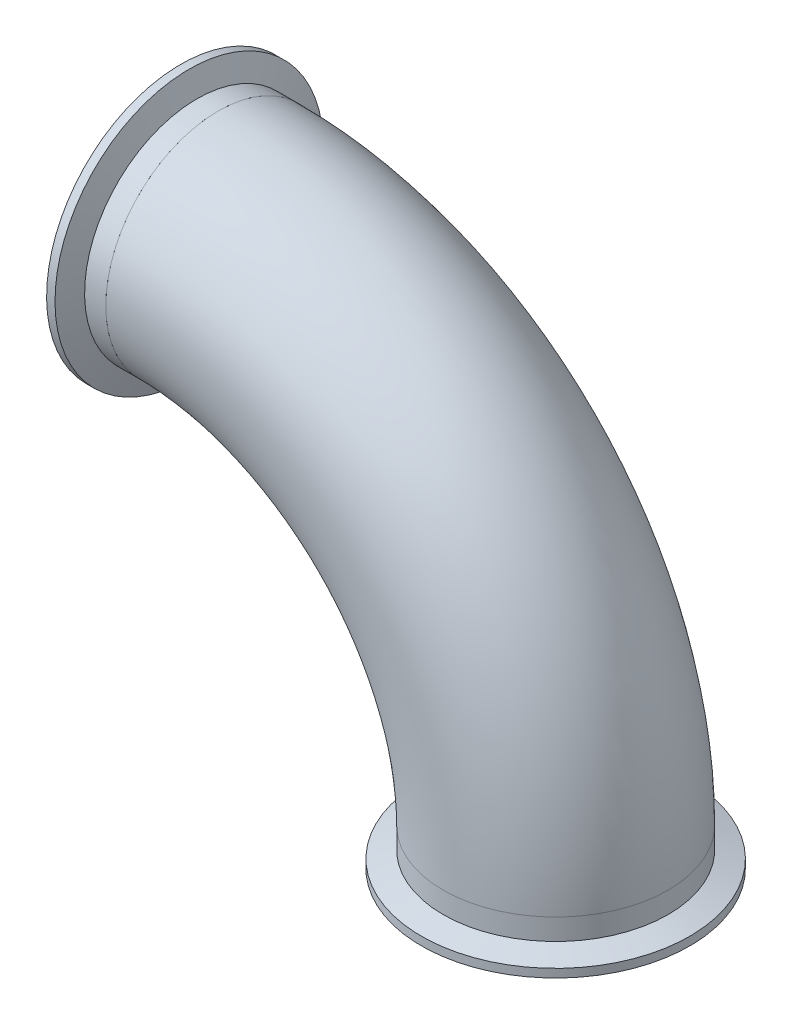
ISO-10303-21;
HEADER;
FILE_DESCRIPTION(('STEP AP214'),'2;1');
FILE_NAME('part.step','',(''),(''),'','','');
FILE_SCHEMA(('AUTOMOTIVE_DESIGN { 1 0 10303 214 1 1 1 1 }'));
ENDSEC;
DATA;
#1=APPLICATION_CONTEXT('core data for automotive mechanical design processes');
#2=APPLICATION_PROTOCOL_DEFINITION('international standard','automotive_design',2000,#1);
#3=PRODUCT_CONTEXT('',#1,'mechanical');
#4=PRODUCT('Part','Part','',(#3));
#5=PRODUCT_RELATED_PRODUCT_CATEGORY('part','',(#4));
#6=PRODUCT_DEFINITION_FORMATION('','',#4);
#7=PRODUCT_DEFINITION_CONTEXT('part definition',#1,'design');
#8=PRODUCT_DEFINITION('design','',#6,#7);
#9=PRODUCT_DEFINITION_SHAPE('','',#8);
#10=(LENGTH_UNIT() NAMED_UNIT(*) SI_UNIT(.MILLI.,.METRE.));
#11=(NAMED_UNIT(*) PLANE_ANGLE_UNIT() SI_UNIT($,.RADIAN.));
#12=(NAMED_UNIT(*) SI_UNIT($,.STERADIAN.) SOLID_ANGLE_UNIT());
#13=UNCERTAINTY_MEASURE_WITH_UNIT(LENGTH_MEASURE(1.E-05),#10,'distance_accuracy_value','');
#14=(GEOMETRIC_REPRESENTATION_CONTEXT(3) GLOBAL_UNCERTAINTY_ASSIGNED_CONTEXT((#13)) GLOBAL_UNIT_ASSIGNED_CONTEXT((#10,
#11,#12)) REPRESENTATION_CONTEXT('',''));
#15=CARTESIAN_POINT('',(0.,0.,0.));
#16=DIRECTION('',(0.,0.,1.));
#17=DIRECTION('',(1.,0.,0.));
#18=AXIS2_PLACEMENT_3D('',#15,#16,#17);
#19=CARTESIAN_POINT('',(137.453026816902,43.9271471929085,150.876164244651));
#20=DIRECTION('',(0.,-1.00000000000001,0.));
#21=DIRECTION('',(0.,0.,-1.));
#22=AXIS2_PLACEMENT_3D('',#19,#20,#21);
#23=TOROIDAL_SURFACE('',#22,43.4867084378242,0.787400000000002);
#24=CARTESIAN_POINT('',(137.453026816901,43.1397471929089,150.876164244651));
#25=DIRECTION('',(0.,-1.00000000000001,0.));
#26=DIRECTION('',(0.,0.,-1.));
#27=AXIS2_PLACEMENT_3D('',#24,#25,#26);
#28=CIRCLE('',#27,43.4867084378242);
#29=CARTESIAN_POINT('',(137.453026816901,43.1397471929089,107.389455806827));
#30=VERTEX_POINT('',#29);
#31=EDGE_CURVE('P0_E48',#30,#30,#28,.T.);
#32=ORIENTED_EDGE('',*,*,#31,.T.);
#33=EDGE_LOOP('',(#32));
#34=FACE_BOUND('',#33,.T.);
#35=CARTESIAN_POINT('',(137.453026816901,43.6142061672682,150.876164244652));
#36=DIRECTION('',(0.,-1.00000000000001,0.));
#37=DIRECTION('',(0.,0.,-1.));
#38=AXIS2_PLACEMENT_3D('',#35,#36,#37);
#39=CIRCLE('',#38,42.7641666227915);
#40=CARTESIAN_POINT('',(137.453026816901,43.6142061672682,108.11199762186));
#41=VERTEX_POINT('',#40);
#42=EDGE_CURVE('P0_E9',#41,#41,#39,.T.);
#43=ORIENTED_EDGE('',*,*,#42,.F.);
#44=EDGE_LOOP('',(#43));
#45=FACE_BOUND('',#44,.T.);
#46=ADVANCED_FACE('P0_F14',(#34,#45),#23,.T.);
#47=CARTESIAN_POINT('',(137.453026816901,43.1397471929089,150.876164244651));
#48=DIRECTION('',(0.,-1.00000000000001,0.));
#49=DIRECTION('',(0.,0.,-1.));
#50=AXIS2_PLACEMENT_3D('',#47,#48,#49);
#51=TOROIDAL_SURFACE('',#50,41.6687,1.1938);
#52=CARTESIAN_POINT('',(137.453026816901,43.6142061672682,150.876164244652));
#53=DIRECTION('',(0.,-1.00000000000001,0.));
#54=DIRECTION('',(0.,0.,-1.));
#55=AXIS2_PLACEMENT_3D('',#52,#53,#54);
#56=CIRCLE('',#55,40.5732333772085);
#57=CARTESIAN_POINT('',(137.453026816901,43.6142061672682,110.302930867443));
#58=VERTEX_POINT('',#57);
#59=EDGE_CURVE('P0_E20',#58,#58,#56,.T.);
#60=ORIENTED_EDGE('',*,*,#59,.F.);
#61=EDGE_LOOP('',(#60));
#62=FACE_BOUND('',#61,.T.);
#63=ORIENTED_EDGE('',*,*,#42,.T.);
#64=EDGE_LOOP('',(#63));
#65=FACE_BOUND('',#64,.T.);
#66=ADVANCED_FACE('P0_F97',(#62,#65),#51,.F.);
#67=CARTESIAN_POINT('',(137.453026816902,43.9271471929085,150.876164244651));
#68=DIRECTION('',(0.,-1.00000000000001,0.));
#69=DIRECTION('',(0.,0.,-1.));
#70=AXIS2_PLACEMENT_3D('',#67,#68,#69);
#71=TOROIDAL_SURFACE('',#70,39.8506915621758,0.787399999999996);
#72=ORIENTED_EDGE('',*,*,#59,.T.);
#73=EDGE_LOOP('',(#72));
#74=FACE_BOUND('',#73,.T.);
#75=CARTESIAN_POINT('',(137.453026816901,43.1397471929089,150.876164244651));
#76=DIRECTION('',(0.,-1.00000000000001,0.));
#77=DIRECTION('',(0.,0.,-1.));
#78=AXIS2_PLACEMENT_3D('',#75,#76,#77);
#79=CIRCLE('',#78,39.8506915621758);
#80=CARTESIAN_POINT('',(137.453026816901,43.1397471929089,111.025472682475));
#81=VERTEX_POINT('',#80);
#82=EDGE_CURVE('P0_E24',#81,#81,#79,.T.);
#83=ORIENTED_EDGE('',*,*,#82,.F.);
#84=EDGE_LOOP('',(#83));
#85=FACE_BOUND('',#84,.T.);
#86=ADVANCED_FACE('P0_F93',(#74,#85),#71,.T.);
#87=CARTESIAN_POINT('',(137.453026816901,43.1397471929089,150.876164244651));
#88=DIRECTION('',(0.,1.00000000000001,0.));
#89=DIRECTION('',(0.,0.,1.));
#90=AXIS2_PLACEMENT_3D('',#87,#88,#89);
#91=PLANE('',#90);
#92=CARTESIAN_POINT('',(137.453026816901,43.1397471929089,150.876164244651));
#93=DIRECTION('',(0.,-1.00000000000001,0.));
#94=DIRECTION('',(0.,0.,-1.));
#95=AXIS2_PLACEMENT_3D('',#92,#93,#94);
#96=CIRCLE('',#95,36.449);
#97=CARTESIAN_POINT('',(137.453026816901,43.1397471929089,114.427164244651));
#98=VERTEX_POINT('',#97);
#99=EDGE_CURVE('P0_E28',#98,#98,#96,.T.);
#100=ORIENTED_EDGE('',*,*,#99,.F.);
#101=EDGE_LOOP('',(#100));
#102=FACE_BOUND('',#101,.T.);
#103=ORIENTED_EDGE('',*,*,#82,.T.);
#104=EDGE_LOOP('',(#103));
#105=FACE_BOUND('',#104,.T.);
#106=ADVANCED_FACE('P0_F86',(#102,#105),#91,.F.);
#107=CARTESIAN_POINT('',(137.453026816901,43.1397471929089,150.876164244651));
#108=DIRECTION('',(0.,-1.00000000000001,0.));
#109=DIRECTION('',(0.,0.,-1.));
#110=AXIS2_PLACEMENT_3D('',#107,#108,#109);
#111=CYLINDRICAL_SURFACE('',#110,36.449);
#112=ORIENTED_EDGE('',*,*,#99,.T.);
#113=EDGE_LOOP('',(#112));
#114=FACE_BOUND('',#113,.T.);
#115=CARTESIAN_POINT('',(137.453026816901,55.8397471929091,150.876164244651));
#116=DIRECTION('',(0.,-1.00000000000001,0.));
#117=DIRECTION('',(0.,0.,-1.));
#118=AXIS2_PLACEMENT_3D('',#115,#116,#117);
#119=CIRCLE('',#118,36.449);
#120=CARTESIAN_POINT('',(137.453026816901,55.8397471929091,114.427164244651));
#121=VERTEX_POINT('',#120);
#122=EDGE_CURVE('P0_E33',#121,#121,#119,.T.);
#123=ORIENTED_EDGE('',*,*,#122,.F.);
#124=EDGE_LOOP('',(#123));
#125=FACE_BOUND('',#124,.T.);
#126=ADVANCED_FACE('P0_F81',(#114,#125),#111,.F.);
#127=CARTESIAN_POINT('',(137.453026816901,55.8397471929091,150.876164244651));
#128=DIRECTION('',(0.,-1.00000000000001,0.));
#129=DIRECTION('',(0.,0.,-1.));
#130=AXIS2_PLACEMENT_3D('',#127,#128,#129);
#131=PLANE('',#130);
#132=CARTESIAN_POINT('',(137.453026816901,55.8397471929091,150.876164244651));
#133=DIRECTION('',(0.,-1.00000000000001,0.));
#134=DIRECTION('',(0.,0.,-1.));
#135=AXIS2_PLACEMENT_3D('',#132,#133,#134);
#136=CIRCLE('',#135,38.1);
#137=CARTESIAN_POINT('',(137.453026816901,55.8397471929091,112.776164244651));
#138=VERTEX_POINT('',#137);
#139=EDGE_CURVE('P0_E36',#138,#138,#136,.T.);
#140=ORIENTED_EDGE('',*,*,#139,.F.);
#141=EDGE_LOOP('',(#140));
#142=FACE_BOUND('',#141,.T.);
#143=ORIENTED_EDGE('',*,*,#122,.T.);
#144=EDGE_LOOP('',(#143));
#145=FACE_BOUND('',#144,.T.);
#146=ADVANCED_FACE('P0_F75',(#142,#145),#131,.F.);
#147=CARTESIAN_POINT('',(137.453026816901,43.1397471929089,150.876164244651));
#148=DIRECTION('',(0.,-1.00000000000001,0.));
#149=DIRECTION('',(0.,0.,-1.));
#150=AXIS2_PLACEMENT_3D('',#147,#148,#149);
#151=CYLINDRICAL_SURFACE('',#150,38.1);
#152=CARTESIAN_POINT('',(137.453026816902,48.6609295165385,150.876164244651));
#153=DIRECTION('',(0.,-1.00000000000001,0.));
#154=DIRECTION('',(0.,0.,-1.));
#155=AXIS2_PLACEMENT_3D('',#152,#153,#154);
#156=CIRCLE('',#155,38.1);
#157=CARTESIAN_POINT('',(137.453026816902,48.6609295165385,112.776164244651));
#158=VERTEX_POINT('',#157);
#159=EDGE_CURVE('P0_E39',#158,#158,#156,.T.);
#160=ORIENTED_EDGE('',*,*,#159,.F.);
#161=EDGE_LOOP('',(#160));
#162=FACE_BOUND('',#161,.T.);
#163=ORIENTED_EDGE('',*,*,#139,.T.);
#164=EDGE_LOOP('',(#163));
#165=FACE_BOUND('',#164,.T.);
#166=ADVANCED_FACE('P0_F69',(#162,#165),#151,.T.);
#167=CARTESIAN_POINT('',(137.453026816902,48.6609295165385,150.876164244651));
#168=DIRECTION('',(0.,-1.00000000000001,0.));
#169=DIRECTION('',(0.,0.,-1.));
#170=AXIS2_PLACEMENT_3D('',#167,#168,#169);
#171=CONICAL_SURFACE('',#170,38.1,1.22173047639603);
#172=CARTESIAN_POINT('',(137.453026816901,45.9845471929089,150.87616424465));
#173=DIRECTION('',(0.,-1.00000000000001,0.));
#174=DIRECTION('',(0.,0.,-1.));
#175=AXIS2_PLACEMENT_3D('',#172,#173,#174);
#176=CIRCLE('',#175,45.4533);
#177=CARTESIAN_POINT('',(137.453026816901,45.9845471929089,105.42286424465));
#178=VERTEX_POINT('',#177);
#179=EDGE_CURVE('P0_E42',#178,#178,#176,.T.);
#180=ORIENTED_EDGE('',*,*,#179,.F.);
#181=EDGE_LOOP('',(#180));
#182=FACE_BOUND('',#181,.T.);
#183=ORIENTED_EDGE('',*,*,#159,.T.);
#184=EDGE_LOOP('',(#183));
#185=FACE_BOUND('',#184,.T.);
#186=ADVANCED_FACE('P0_F63',(#182,#185),#171,.T.);
#187=CARTESIAN_POINT('',(137.453026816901,43.1397471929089,150.876164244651));
#188=DIRECTION('',(0.,-1.00000000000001,0.));
#189=DIRECTION('',(0.,0.,-1.));
#190=AXIS2_PLACEMENT_3D('',#187,#188,#189);
#191=CYLINDRICAL_SURFACE('',#190,45.4533);
#192=CARTESIAN_POINT('',(137.453026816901,43.1397471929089,150.876164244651));
#193=DIRECTION('',(0.,-1.00000000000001,0.));
#194=DIRECTION('',(0.,0.,-1.));
#195=AXIS2_PLACEMENT_3D('',#192,#193,#194);
#196=CIRCLE('',#195,45.4533);
#197=CARTESIAN_POINT('',(137.453026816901,43.1397471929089,105.422864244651));
#198=VERTEX_POINT('',#197);
#199=EDGE_CURVE('P0_E45',#198,#198,#196,.T.);
#200=ORIENTED_EDGE('',*,*,#199,.F.);
#201=EDGE_LOOP('',(#200));
#202=FACE_BOUND('',#201,.T.);
#203=ORIENTED_EDGE('',*,*,#179,.T.);
#204=EDGE_LOOP('',(#203));
#205=FACE_BOUND('',#204,.T.);
#206=ADVANCED_FACE('P0_F57',(#202,#205),#191,.T.);
#207=CARTESIAN_POINT('',(137.453026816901,43.1397471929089,150.876164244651));
#208=DIRECTION('',(0.,1.00000000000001,0.));
#209=DIRECTION('',(0.,0.,1.));
#210=AXIS2_PLACEMENT_3D('',#207,#208,#209);
#211=PLANE('',#210);
#212=ORIENTED_EDGE('',*,*,#31,.F.);
#213=EDGE_LOOP('',(#212));
#214=FACE_BOUND('',#213,.T.);
#215=ORIENTED_EDGE('',*,*,#199,.T.);
#216=EDGE_LOOP('',(#215));
#217=FACE_BOUND('',#216,.T.);
#218=ADVANCED_FACE('P0_F54',(#214,#217),#211,.F.);
#219=CLOSED_SHELL('',(#46,#66,#86,#106,#126,#146,#166,#186,#206,#218));
#220=MANIFOLD_SOLID_BREP('P0_B1',#219);
#221=CARTESIAN_POINT('',(11.2404268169,170.139747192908,150.87616424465));
#222=DIRECTION('',(-1.00000000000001,0.,0.));
#223=DIRECTION('',(0.,0.518359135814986,-0.855163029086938));
#224=AXIS2_PLACEMENT_3D('',#221,#222,#223);
#225=TOROIDAL_SURFACE('',#224,43.4867084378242,0.787400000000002);
#226=CARTESIAN_POINT('',(10.4530268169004,170.139747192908,150.87616424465));
#227=DIRECTION('',(-1.00000000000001,0.,0.));
#228=DIRECTION('',(0.,0.518359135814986,-0.855163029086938));
#229=AXIS2_PLACEMENT_3D('',#226,#227,#228);
#230=CIRCLE('',#229,43.4867084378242);
#231=CARTESIAN_POINT('',(10.4530268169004,192.681479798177,113.68793893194));
#232=VERTEX_POINT('',#231);
#233=EDGE_CURVE('P1_E49',#232,#232,#230,.T.);
#234=ORIENTED_EDGE('',*,*,#233,.T.);
#235=EDGE_LOOP('',(#234));
#236=FACE_BOUND('',#235,.T.);
#237=CARTESIAN_POINT('',(10.9274857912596,170.139747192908,150.876164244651));
#238=DIRECTION('',(-1.00000000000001,0.,0.));
#239=DIRECTION('',(0.,0.518359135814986,-0.855163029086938));
#240=AXIS2_PLACEMENT_3D('',#237,#238,#239);
#241=CIRCLE('',#240,42.7641666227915);
#242=CARTESIAN_POINT('',(10.9274857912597,192.306943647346,114.305829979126));
#243=VERTEX_POINT('',#242);
#244=EDGE_CURVE('P1_E10',#243,#243,#241,.T.);
#245=ORIENTED_EDGE('',*,*,#244,.F.);
#246=EDGE_LOOP('',(#245));
#247=FACE_BOUND('',#246,.T.);
#248=ADVANCED_FACE('P1_F15',(#236,#247),#225,.T.);
#249=CARTESIAN_POINT('',(10.4530268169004,170.139747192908,150.87616424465));
#250=DIRECTION('',(-1.00000000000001,0.,0.));
#251=DIRECTION('',(0.,0.518359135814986,-0.855163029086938));
#252=AXIS2_PLACEMENT_3D('',#249,#250,#251);
#253=TOROIDAL_SURFACE('',#252,41.6687,1.1938);
#254=CARTESIAN_POINT('',(10.9274857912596,170.139747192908,150.876164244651));
#255=DIRECTION('',(-1.00000000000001,0.,0.));
#256=DIRECTION('',(0.,0.518359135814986,-0.855163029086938));
#257=AXIS2_PLACEMENT_3D('',#254,#255,#256);
#258=CIRCLE('',#257,40.5732333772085);
#259=CARTESIAN_POINT('',(10.9274857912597,191.171253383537,116.179435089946));
#260=VERTEX_POINT('',#259);
#261=EDGE_CURVE('P1_E21',#260,#260,#258,.T.);
#262=ORIENTED_EDGE('',*,*,#261,.F.);
#263=EDGE_LOOP('',(#262));
#264=FACE_BOUND('',#263,.T.);
#265=ORIENTED_EDGE('',*,*,#244,.T.);
#266=EDGE_LOOP('',(#265));
#267=FACE_BOUND('',#266,.T.);
#268=ADVANCED_FACE('P1_F98',(#264,#267),#253,.F.);
#269=CARTESIAN_POINT('',(11.2404268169,170.139747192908,150.87616424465));
#270=DIRECTION('',(-1.00000000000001,0.,0.));
#271=DIRECTION('',(0.,0.518359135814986,-0.855163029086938));
#272=AXIS2_PLACEMENT_3D('',#269,#270,#271);
#273=TOROIDAL_SURFACE('',#272,39.8506915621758,0.787399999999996);
#274=ORIENTED_EDGE('',*,*,#261,.T.);
#275=EDGE_LOOP('',(#274));
#276=FACE_BOUND('',#275,.T.);
#277=CARTESIAN_POINT('',(10.4530268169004,170.139747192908,150.87616424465));
#278=DIRECTION('',(-1.00000000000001,0.,0.));
#279=DIRECTION('',(0.,0.518359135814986,-0.855163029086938));
#280=AXIS2_PLACEMENT_3D('',#277,#278,#279);
#281=CIRCLE('',#280,39.8506915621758);
#282=CARTESIAN_POINT('',(10.4530268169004,190.796717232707,116.797326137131));
#283=VERTEX_POINT('',#282);
#284=EDGE_CURVE('P1_E25',#283,#283,#281,.T.);
#285=ORIENTED_EDGE('',*,*,#284,.F.);
#286=EDGE_LOOP('',(#285));
#287=FACE_BOUND('',#286,.T.);
#288=ADVANCED_FACE('P1_F94',(#276,#287),#273,.T.);
#289=CARTESIAN_POINT('',(10.4530268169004,170.139747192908,150.87616424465));
#290=DIRECTION('',(1.00000000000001,0.,0.));
#291=DIRECTION('',(0.,-0.518359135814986,0.855163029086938));
#292=AXIS2_PLACEMENT_3D('',#289,#290,#291);
#293=PLANE('',#292);
#294=CARTESIAN_POINT('',(10.4530268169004,170.139747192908,150.87616424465));
#295=DIRECTION('',(-1.00000000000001,0.,0.));
#296=DIRECTION('',(0.,0.518359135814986,-0.855163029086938));
#297=AXIS2_PLACEMENT_3D('',#294,#295,#296);
#298=CIRCLE('',#297,36.449);
#299=CARTESIAN_POINT('',(10.4530268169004,189.033419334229,119.706326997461));
#300=VERTEX_POINT('',#299);
#301=EDGE_CURVE('P1_E29',#300,#300,#298,.T.);
#302=ORIENTED_EDGE('',*,*,#301,.F.);
#303=EDGE_LOOP('',(#302));
#304=FACE_BOUND('',#303,.T.);
#305=ORIENTED_EDGE('',*,*,#284,.T.);
#306=EDGE_LOOP('',(#305));
#307=FACE_BOUND('',#306,.T.);
#308=ADVANCED_FACE('P1_F87',(#304,#307),#293,.F.);
#309=CARTESIAN_POINT('',(10.4530268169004,170.139747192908,150.87616424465));
#310=DIRECTION('',(-1.00000000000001,0.,0.));
#311=DIRECTION('',(0.,0.518359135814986,-0.855163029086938));
#312=AXIS2_PLACEMENT_3D('',#309,#310,#311);
#313=CYLINDRICAL_SURFACE('',#312,36.449);
#314=ORIENTED_EDGE('',*,*,#301,.T.);
#315=EDGE_LOOP('',(#314));
#316=FACE_BOUND('',#315,.T.);
#317=CARTESIAN_POINT('',(23.1530268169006,170.139747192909,150.876164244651));
#318=DIRECTION('',(-1.00000000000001,0.,0.));
#319=DIRECTION('',(0.,0.518359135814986,-0.855163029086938));
#320=AXIS2_PLACEMENT_3D('',#317,#318,#319);
#321=CIRCLE('',#320,36.449);
#322=CARTESIAN_POINT('',(23.1530268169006,189.033419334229,119.706326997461));
#323=VERTEX_POINT('',#322);
#324=EDGE_CURVE('P1_E34',#323,#323,#321,.T.);
#325=ORIENTED_EDGE('',*,*,#324,.F.);
#326=EDGE_LOOP('',(#325));
#327=FACE_BOUND('',#326,.T.);
#328=ADVANCED_FACE('P1_F82',(#316,#327),#313,.F.);
#329=CARTESIAN_POINT('',(23.1530268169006,170.139747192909,150.876164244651));
#330=DIRECTION('',(-1.00000000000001,0.,0.));
#331=DIRECTION('',(0.,0.518359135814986,-0.855163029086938));
#332=AXIS2_PLACEMENT_3D('',#329,#330,#331);
#333=PLANE('',#332);
#334=CARTESIAN_POINT('',(23.1530268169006,170.139747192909,150.876164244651));
#335=DIRECTION('',(-1.00000000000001,0.,0.));
#336=DIRECTION('',(0.,0.518359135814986,-0.855163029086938));
#337=AXIS2_PLACEMENT_3D('',#334,#335,#336);
#338=CIRCLE('',#337,38.1);
#339=CARTESIAN_POINT('',(23.1530268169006,189.88923026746,118.294452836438));
#340=VERTEX_POINT('',#339);
#341=EDGE_CURVE('P1_E37',#340,#340,#338,.T.);
#342=ORIENTED_EDGE('',*,*,#341,.F.);
#343=EDGE_LOOP('',(#342));
#344=FACE_BOUND('',#343,.T.);
#345=ORIENTED_EDGE('',*,*,#324,.T.);
#346=EDGE_LOOP('',(#345));
#347=FACE_BOUND('',#346,.T.);
#348=ADVANCED_FACE('P1_F76',(#344,#347),#333,.F.);
#349=CARTESIAN_POINT('',(10.4530268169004,170.139747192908,150.87616424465));
#350=DIRECTION('',(-1.00000000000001,0.,0.));
#351=DIRECTION('',(0.,0.518359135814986,-0.855163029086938));
#352=AXIS2_PLACEMENT_3D('',#349,#350,#351);
#353=CYLINDRICAL_SURFACE('',#352,38.1);
#354=CARTESIAN_POINT('',(15.97420914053,170.139747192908,150.876164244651));
#355=DIRECTION('',(-1.00000000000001,0.,0.));
#356=DIRECTION('',(0.,0.518359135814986,-0.855163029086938));
#357=AXIS2_PLACEMENT_3D('',#354,#355,#356);
#358=CIRCLE('',#357,38.1);
#359=CARTESIAN_POINT('',(15.97420914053,189.889230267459,118.294452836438));
#360=VERTEX_POINT('',#359);
#361=EDGE_CURVE('P1_E40',#360,#360,#358,.T.);
#362=ORIENTED_EDGE('',*,*,#361,.F.);
#363=EDGE_LOOP('',(#362));
#364=FACE_BOUND('',#363,.T.);
#365=ORIENTED_EDGE('',*,*,#341,.T.);
#366=EDGE_LOOP('',(#365));
#367=FACE_BOUND('',#366,.T.);
#368=ADVANCED_FACE('P1_F70',(#364,#367),#353,.T.);
#369=CARTESIAN_POINT('',(15.97420914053,170.139747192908,150.876164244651));
#370=DIRECTION('',(-1.00000000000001,0.,0.));
#371=DIRECTION('',(0.,0.518359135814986,-0.855163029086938));
#372=AXIS2_PLACEMENT_3D('',#369,#370,#371);
#373=CONICAL_SURFACE('',#372,38.1,1.22173047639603);
#374=CARTESIAN_POINT('',(13.2978268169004,170.139747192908,150.87616424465));
#375=DIRECTION('',(-1.00000000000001,0.,0.));
#376=DIRECTION('',(0.,0.518359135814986,-0.855163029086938));
#377=AXIS2_PLACEMENT_3D('',#374,#375,#376);
#378=CIRCLE('',#377,45.4533);
#379=CARTESIAN_POINT('',(13.2978268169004,193.700880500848,112.006182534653));
#380=VERTEX_POINT('',#379);
#381=EDGE_CURVE('P1_E43',#380,#380,#378,.T.);
#382=ORIENTED_EDGE('',*,*,#381,.F.);
#383=EDGE_LOOP('',(#382));
#384=FACE_BOUND('',#383,.T.);
#385=ORIENTED_EDGE('',*,*,#361,.T.);
#386=EDGE_LOOP('',(#385));
#387=FACE_BOUND('',#386,.T.);
#388=ADVANCED_FACE('P1_F64',(#384,#387),#373,.T.);
#389=CARTESIAN_POINT('',(10.4530268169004,170.139747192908,150.87616424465));
#390=DIRECTION('',(-1.00000000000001,0.,0.));
#391=DIRECTION('',(0.,0.518359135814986,-0.855163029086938));
#392=AXIS2_PLACEMENT_3D('',#389,#390,#391);
#393=CYLINDRICAL_SURFACE('',#392,45.4533);
#394=CARTESIAN_POINT('',(10.4530268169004,170.139747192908,150.87616424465));
#395=DIRECTION('',(-1.00000000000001,0.,0.));
#396=DIRECTION('',(0.,0.518359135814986,-0.855163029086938));
#397=AXIS2_PLACEMENT_3D('',#394,#395,#396);
#398=CIRCLE('',#397,45.4533);
#399=CARTESIAN_POINT('',(10.4530268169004,193.700880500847,112.006182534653));
#400=VERTEX_POINT('',#399);
#401=EDGE_CURVE('P1_E46',#400,#400,#398,.T.);
#402=ORIENTED_EDGE('',*,*,#401,.F.);
#403=EDGE_LOOP('',(#402));
#404=FACE_BOUND('',#403,.T.);
#405=ORIENTED_EDGE('',*,*,#381,.T.);
#406=EDGE_LOOP('',(#405));
#407=FACE_BOUND('',#406,.T.);
#408=ADVANCED_FACE('P1_F58',(#404,#407),#393,.T.);
#409=CARTESIAN_POINT('',(10.4530268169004,170.139747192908,150.87616424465));
#410=DIRECTION('',(1.00000000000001,0.,0.));
#411=DIRECTION('',(0.,-0.518359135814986,0.855163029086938));
#412=AXIS2_PLACEMENT_3D('',#409,#410,#411);
#413=PLANE('',#412);
#414=ORIENTED_EDGE('',*,*,#233,.F.);
#415=EDGE_LOOP('',(#414));
#416=FACE_BOUND('',#415,.T.);
#417=ORIENTED_EDGE('',*,*,#401,.T.);
#418=EDGE_LOOP('',(#417));
#419=FACE_BOUND('',#418,.T.);
#420=ADVANCED_FACE('P1_F55',(#416,#419),#413,.F.);
#421=CLOSED_SHELL('',(#248,#268,#288,#308,#328,#348,#368,#388,#408,#420));
#422=MANIFOLD_SOLID_BREP('P1_B1',#421);
#423=CARTESIAN_POINT('',(23.1530268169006,55.839747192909,150.876164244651));
#424=DIRECTION('',(0.,0.,-1.));
#425=DIRECTION('',(-1.,0.,0.));
#426=AXIS2_PLACEMENT_3D('',#423,#424,#425);
#427=TOROIDAL_SURFACE('',#426,114.3,36.449);
#428=CARTESIAN_POINT('',(23.1530268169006,170.139747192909,150.876164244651));
#429=DIRECTION('',(-1.,0.,0.));
#430=DIRECTION('',(0.,0.,1.));
#431=AXIS2_PLACEMENT_3D('',#428,#429,#430);
#432=CIRCLE('',#431,36.449);
#433=CARTESIAN_POINT('',(23.1530268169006,206.588747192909,150.876164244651));
#434=VERTEX_POINT('',#433);
#435=EDGE_CURVE('P2_E22',#434,#434,#432,.T.);
#436=CARTESIAN_POINT('',(137.453026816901,55.8397471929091,150.876164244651));
#437=DIRECTION('',(0.,1.,0.));
#438=DIRECTION('',(0.,0.,1.));
#439=AXIS2_PLACEMENT_3D('',#436,#437,#438);
#440=CIRCLE('',#439,36.449);
#441=CARTESIAN_POINT('',(173.902026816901,55.8397471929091,150.876164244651));
#442=VERTEX_POINT('',#441);
#443=EDGE_CURVE('P2_E30',#442,#442,#440,.T.);
#444=CARTESIAN_POINT('',(23.1530268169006,55.839747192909,150.876164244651));
#445=DIRECTION('',(0.,0.,-1.));
#446=DIRECTION('',(-1.,0.,0.));
#447=AXIS2_PLACEMENT_3D('',#444,#445,#446);
#448=CIRCLE('',#447,150.749);
#449=EDGE_CURVE('',#434,#442,#448,.T.);
#450=ORIENTED_EDGE('',*,*,#435,.T.);
#451=ORIENTED_EDGE('',*,*,#443,.F.);
#452=ORIENTED_EDGE('',*,*,#449,.T.);
#453=ORIENTED_EDGE('',*,*,#449,.F.);
#454=EDGE_LOOP('',(#450,#452,#451,#453));
#455=FACE_BOUND('',#454,.T.);
#456=ADVANCED_FACE('P2_F15',(#455),#427,.F.);
#457=CARTESIAN_POINT('',(23.1530268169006,55.839747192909,150.876164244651));
#458=DIRECTION('',(0.,0.,-1.));
#459=DIRECTION('',(-1.,0.,0.));
#460=AXIS2_PLACEMENT_3D('',#457,#458,#459);
#461=TOROIDAL_SURFACE('',#460,114.3,38.1);
#462=CARTESIAN_POINT('',(23.1530268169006,170.139747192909,150.876164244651));
#463=DIRECTION('',(-1.,0.,0.));
#464=DIRECTION('',(0.,0.,1.));
#465=AXIS2_PLACEMENT_3D('',#462,#463,#464);
#466=CIRCLE('',#465,38.1);
#467=CARTESIAN_POINT('',(23.1530268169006,208.239747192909,150.876164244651));
#468=VERTEX_POINT('',#467);
#469=EDGE_CURVE('P2_E10',#468,#468,#466,.T.);
#470=CARTESIAN_POINT('',(137.453026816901,55.8397471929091,150.876164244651));
#471=DIRECTION('',(0.,1.,0.));
#472=DIRECTION('',(0.,0.,1.));
#473=AXIS2_PLACEMENT_3D('',#470,#471,#472);
#474=CIRCLE('',#473,38.1);
#475=CARTESIAN_POINT('',(175.553026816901,55.8397471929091,150.876164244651));
#476=VERTEX_POINT('',#475);
#477=EDGE_CURVE('P2_E26',#476,#476,#474,.T.);
#478=CARTESIAN_POINT('',(23.1530268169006,55.839747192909,150.876164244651));
#479=DIRECTION('',(0.,0.,-1.));
#480=DIRECTION('',(-1.,0.,0.));
#481=AXIS2_PLACEMENT_3D('',#478,#479,#480);
#482=CIRCLE('',#481,152.4);
#483=EDGE_CURVE('',#468,#476,#482,.T.);
#484=ORIENTED_EDGE('',*,*,#469,.F.);
#485=ORIENTED_EDGE('',*,*,#477,.T.);
#486=ORIENTED_EDGE('',*,*,#483,.T.);
#487=ORIENTED_EDGE('',*,*,#483,.F.);
#488=EDGE_LOOP('',(#484,#486,#485,#487));
#489=FACE_BOUND('',#488,.T.);
#490=ADVANCED_FACE('P2_F17',(#489),#461,.T.);
#491=CARTESIAN_POINT('',(23.1530268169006,170.139747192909,150.876164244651));
#492=DIRECTION('',(-1.,0.,0.));
#493=DIRECTION('',(0.,0.,1.));
#494=AXIS2_PLACEMENT_3D('',#491,#492,#493);
#495=PLANE('',#494);
#496=ORIENTED_EDGE('',*,*,#435,.F.);
#497=EDGE_LOOP('',(#496));
#498=FACE_BOUND('',#497,.T.);
#499=ORIENTED_EDGE('',*,*,#469,.T.);
#500=EDGE_LOOP('',(#499));
#501=FACE_BOUND('',#500,.T.);
#502=ADVANCED_FACE('P2_F44',(#498,#501),#495,.T.);
#503=CARTESIAN_POINT('',(137.453026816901,55.8397471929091,150.876164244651));
#504=DIRECTION('',(0.,1.,0.));
#505=DIRECTION('',(0.,0.,1.));
#506=AXIS2_PLACEMENT_3D('',#503,#504,#505);
#507=PLANE('',#506);
#508=ORIENTED_EDGE('',*,*,#443,.T.);
#509=EDGE_LOOP('',(#508));
#510=FACE_BOUND('',#509,.T.);
#511=ORIENTED_EDGE('',*,*,#477,.F.);
#512=EDGE_LOOP('',(#511));
#513=FACE_BOUND('',#512,.T.);
#514=ADVANCED_FACE('P2_F36',(#510,#513),#507,.F.);
#515=CLOSED_SHELL('',(#456,#490,#502,#514));
#516=MANIFOLD_SOLID_BREP('P2_B1',#515);
#517=ADVANCED_BREP_SHAPE_REPRESENTATION('',(#18,#220,#422,#516),#14);
#518=SHAPE_DEFINITION_REPRESENTATION(#9,#517);
ENDSEC;
END-ISO-10303-21;
